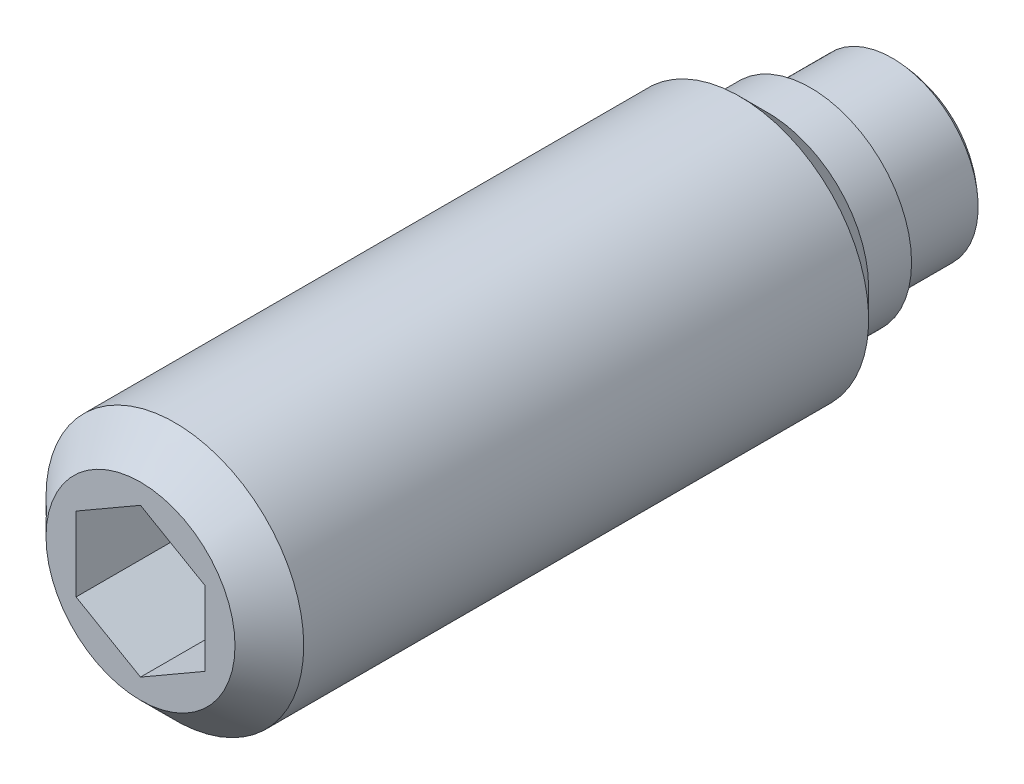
ISO-10303-21;
HEADER;
FILE_DESCRIPTION(('STEP AP214'),'2;1');
FILE_NAME('part.step','',(''),(''),'','','');
FILE_SCHEMA(('AUTOMOTIVE_DESIGN { 1 0 10303 214 1 1 1 1 }'));
ENDSEC;
DATA;
#1=APPLICATION_CONTEXT('core data for automotive mechanical design processes');
#2=APPLICATION_PROTOCOL_DEFINITION('international standard','automotive_design',2000,#1);
#3=PRODUCT_CONTEXT('',#1,'mechanical');
#4=PRODUCT('Part','Part','',(#3));
#5=PRODUCT_RELATED_PRODUCT_CATEGORY('part','',(#4));
#6=PRODUCT_DEFINITION_FORMATION('','',#4);
#7=PRODUCT_DEFINITION_CONTEXT('part definition',#1,'design');
#8=PRODUCT_DEFINITION('design','',#6,#7);
#9=PRODUCT_DEFINITION_SHAPE('','',#8);
#10=(LENGTH_UNIT() NAMED_UNIT(*) SI_UNIT(.MILLI.,.METRE.));
#11=(NAMED_UNIT(*) PLANE_ANGLE_UNIT() SI_UNIT($,.RADIAN.));
#12=(NAMED_UNIT(*) SI_UNIT($,.STERADIAN.) SOLID_ANGLE_UNIT());
#13=UNCERTAINTY_MEASURE_WITH_UNIT(LENGTH_MEASURE(1.E-05),#10,'distance_accuracy_value','');
#14=(GEOMETRIC_REPRESENTATION_CONTEXT(3) GLOBAL_UNCERTAINTY_ASSIGNED_CONTEXT((#13)) GLOBAL_UNIT_ASSIGNED_CONTEXT((#10,
#11,#12)) REPRESENTATION_CONTEXT('',''));
#15=CARTESIAN_POINT('',(0.,0.,0.));
#16=DIRECTION('',(0.,0.,1.));
#17=DIRECTION('',(1.,0.,0.));
#18=AXIS2_PLACEMENT_3D('',#15,#16,#17);
#19=CARTESIAN_POINT('',(0.,2.35,2.7));
#20=DIRECTION('',(0.,0.,1.));
#21=DIRECTION('',(1.,0.,0.));
#22=AXIS2_PLACEMENT_3D('',#19,#20,#21);
#23=PLANE('',#22);
#24=CARTESIAN_POINT('',(0.,0.,2.7));
#25=DIRECTION('',(0.,0.,-1.));
#26=DIRECTION('',(-1.,0.,0.));
#27=AXIS2_PLACEMENT_3D('',#24,#25,#26);
#28=CIRCLE('',#27,2.);
#29=CARTESIAN_POINT('',(-2.00000000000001,0.,2.7));
#30=VERTEX_POINT('',#29);
#31=EDGE_CURVE('E124',#30,#30,#28,.T.);
#32=ORIENTED_EDGE('',*,*,#31,.F.);
#33=EDGE_LOOP('',(#32));
#34=FACE_BOUND('',#33,.T.);
#35=CARTESIAN_POINT('',(0.,0.,2.7));
#36=DIRECTION('',(0.,0.,-1.));
#37=DIRECTION('',(-1.,0.,0.));
#38=AXIS2_PLACEMENT_3D('',#35,#36,#37);
#39=CIRCLE('',#38,2.35);
#40=CARTESIAN_POINT('',(-2.35000000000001,0.,2.7));
#41=VERTEX_POINT('',#40);
#42=EDGE_CURVE('E127',#41,#41,#39,.T.);
#43=ORIENTED_EDGE('',*,*,#42,.T.);
#44=EDGE_LOOP('',(#43));
#45=FACE_BOUND('',#44,.T.);
#46=ADVANCED_FACE('F14',(#34,#45),#23,.F.);
#47=CARTESIAN_POINT('',(0.,0.,2.7));
#48=DIRECTION('',(0.,0.,-1.));
#49=DIRECTION('',(-1.,0.,0.));
#50=AXIS2_PLACEMENT_3D('',#47,#48,#49);
#51=CYLINDRICAL_SURFACE('',#50,3.);
#52=CARTESIAN_POINT('',(0.,0.,17.5));
#53=DIRECTION('',(0.,0.,1.));
#54=DIRECTION('',(1.,0.,0.));
#55=AXIS2_PLACEMENT_3D('',#52,#53,#54);
#56=CIRCLE('',#55,3.);
#57=CARTESIAN_POINT('',(2.99999999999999,0.,17.5));
#58=VERTEX_POINT('',#57);
#59=EDGE_CURVE('E9',#58,#58,#56,.F.);
#60=ORIENTED_EDGE('',*,*,#59,.T.);
#61=EDGE_LOOP('',(#60));
#62=FACE_BOUND('',#61,.T.);
#63=CARTESIAN_POINT('',(0.,0.,4.35));
#64=DIRECTION('',(0.,0.,-1.));
#65=DIRECTION('',(-1.,0.,0.));
#66=AXIS2_PLACEMENT_3D('',#63,#64,#65);
#67=CIRCLE('',#66,3.);
#68=CARTESIAN_POINT('',(-3.00000000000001,0.,4.35));
#69=VERTEX_POINT('',#68);
#70=EDGE_CURVE('E133',#69,#69,#67,.T.);
#71=ORIENTED_EDGE('',*,*,#70,.F.);
#72=EDGE_LOOP('',(#71));
#73=FACE_BOUND('',#72,.T.);
#74=ADVANCED_FACE('F151',(#62,#73),#51,.T.);
#75=CARTESIAN_POINT('',(0.,0.,4.35));
#76=DIRECTION('',(0.,0.,1.));
#77=DIRECTION('',(1.,0.,0.));
#78=AXIS2_PLACEMENT_3D('',#75,#76,#77);
#79=CONICAL_SURFACE('',#78,3.,0.785398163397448);
#80=CARTESIAN_POINT('',(0.,0.,3.7));
#81=DIRECTION('',(0.,0.,-1.));
#82=DIRECTION('',(-1.,0.,0.));
#83=AXIS2_PLACEMENT_3D('',#80,#81,#82);
#84=CIRCLE('',#83,2.35);
#85=CARTESIAN_POINT('',(-2.35000000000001,0.,3.7));
#86=VERTEX_POINT('',#85);
#87=EDGE_CURVE('E130',#86,#86,#84,.T.);
#88=ORIENTED_EDGE('',*,*,#87,.F.);
#89=EDGE_LOOP('',(#88));
#90=FACE_BOUND('',#89,.T.);
#91=ORIENTED_EDGE('',*,*,#70,.T.);
#92=EDGE_LOOP('',(#91));
#93=FACE_BOUND('',#92,.T.);
#94=ADVANCED_FACE('F158',(#90,#93),#79,.T.);
#95=CARTESIAN_POINT('',(0.,0.,2.7));
#96=DIRECTION('',(0.,0.,-1.));
#97=DIRECTION('',(-1.,0.,0.));
#98=AXIS2_PLACEMENT_3D('',#95,#96,#97);
#99=CYLINDRICAL_SURFACE('',#98,2.35);
#100=ORIENTED_EDGE('',*,*,#42,.F.);
#101=EDGE_LOOP('',(#100));
#102=FACE_BOUND('',#101,.T.);
#103=ORIENTED_EDGE('',*,*,#87,.T.);
#104=EDGE_LOOP('',(#103));
#105=FACE_BOUND('',#104,.T.);
#106=ADVANCED_FACE('F166',(#102,#105),#99,.T.);
#107=CARTESIAN_POINT('',(0.,0.,0.));
#108=DIRECTION('',(0.,0.,-1.));
#109=DIRECTION('',(-1.,0.,0.));
#110=AXIS2_PLACEMENT_3D('',#107,#108,#109);
#111=CYLINDRICAL_SURFACE('',#110,2.);
#112=CARTESIAN_POINT('',(0.,0.,0.8));
#113=DIRECTION('',(0.,0.,-1.));
#114=DIRECTION('',(-1.,0.,0.));
#115=AXIS2_PLACEMENT_3D('',#112,#113,#114);
#116=CIRCLE('',#115,2.);
#117=CARTESIAN_POINT('',(-2.00000000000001,0.,0.8));
#118=VERTEX_POINT('',#117);
#119=EDGE_CURVE('E114',#118,#118,#116,.T.);
#120=ORIENTED_EDGE('',*,*,#119,.F.);
#121=EDGE_LOOP('',(#120));
#122=FACE_BOUND('',#121,.T.);
#123=ORIENTED_EDGE('',*,*,#31,.T.);
#124=EDGE_LOOP('',(#123));
#125=FACE_BOUND('',#124,.T.);
#126=ADVANCED_FACE('F164',(#122,#125),#111,.T.);
#127=CARTESIAN_POINT('',(0.0398938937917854,0.,2.9997347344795));
#128=DIRECTION('',(0.,-1.,0.));
#129=DIRECTION('',(-1.,0.,0.));
#130=AXIS2_PLACEMENT_3D('',#127,#128,#129);
#131=CIRCLE('',#130,3.00000000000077);
#132=TRIMMED_CURVE('',#131,(PARAMETER_VALUE(-1.55749797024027)),
(PARAMETER_VALUE(1.55749797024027)),.T.,.PARAMETER.);
#133=CARTESIAN_POINT('',(0.,0.,2.9997347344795));
#134=DIRECTION('',(0.,0.,-1.));
#135=AXIS1_PLACEMENT('',#133,#134);
#136=SURFACE_OF_REVOLUTION('',#132,#135);
#137=ORIENTED_EDGE('',*,*,#119,.T.);
#138=EDGE_LOOP('',(#137));
#139=FACE_BOUND('',#138,.T.);
#140=CARTESIAN_POINT('',(0.,0.,0.));
#141=VERTEX_POINT('',#140);
#142=VERTEX_LOOP('',#141);
#143=FACE_BOUND('',#142,.T.);
#144=ADVANCED_FACE('F198',(#139,#143),#136,.T.);
#145=CARTESIAN_POINT('',(0.,0.,18.3));
#146=DIRECTION('',(0.,0.,1.));
#147=DIRECTION('',(1.,0.,0.));
#148=AXIS2_PLACEMENT_3D('',#145,#146,#147);
#149=PLANE('',#148);
#150=CARTESIAN_POINT('',(0.,0.,18.3));
#151=DIRECTION('',(0.,0.,1.));
#152=DIRECTION('',(1.,0.,0.));
#153=AXIS2_PLACEMENT_3D('',#150,#151,#152);
#154=CIRCLE('',#153,2.2);
#155=CARTESIAN_POINT('',(2.19999999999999,0.,18.3));
#156=VERTEX_POINT('',#155);
#157=EDGE_CURVE('E22',#156,#156,#154,.T.);
#158=ORIENTED_EDGE('',*,*,#157,.T.);
#159=EDGE_LOOP('',(#158));
#160=FACE_BOUND('',#159,.T.);
#161=DIRECTION('',(-0.866025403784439,0.5,0.));
#162=VECTOR('',#161,1.);
#163=CARTESIAN_POINT('',(1.5,0.866025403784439,18.3));
#164=LINE('',#163,#162);
#165=CARTESIAN_POINT('',(1.5,0.866025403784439,18.3));
#166=VERTEX_POINT('',#165);
#167=CARTESIAN_POINT('',(0.,1.73205080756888,18.3));
#168=VERTEX_POINT('',#167);
#169=EDGE_CURVE('E29',#166,#168,#164,.T.);
#170=ORIENTED_EDGE('',*,*,#169,.F.);
#171=DIRECTION('',(0.,1.,0.));
#172=VECTOR('',#171,1.);
#173=CARTESIAN_POINT('',(1.5,-0.866025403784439,18.3));
#174=LINE('',#173,#172);
#175=CARTESIAN_POINT('',(1.5,-0.866025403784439,18.3));
#176=VERTEX_POINT('',#175);
#177=EDGE_CURVE('E88',#176,#166,#174,.T.);
#178=ORIENTED_EDGE('',*,*,#177,.F.);
#179=DIRECTION('',(0.866025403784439,0.5,0.));
#180=VECTOR('',#179,1.);
#181=CARTESIAN_POINT('',(0.,-1.73205080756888,18.3));
#182=LINE('',#181,#180);
#183=CARTESIAN_POINT('',(0.,-1.73205080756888,18.3));
#184=VERTEX_POINT('',#183);
#185=EDGE_CURVE('E91',#184,#176,#182,.T.);
#186=ORIENTED_EDGE('',*,*,#185,.F.);
#187=DIRECTION('',(0.866025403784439,-0.5,0.));
#188=VECTOR('',#187,1.);
#189=CARTESIAN_POINT('',(-1.5,-0.866025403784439,18.3));
#190=LINE('',#189,#188);
#191=CARTESIAN_POINT('',(-1.5,-0.866025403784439,18.3));
#192=VERTEX_POINT('',#191);
#193=EDGE_CURVE('E107',#192,#184,#190,.T.);
#194=ORIENTED_EDGE('',*,*,#193,.F.);
#195=DIRECTION('',(0.,-1.,0.));
#196=VECTOR('',#195,1.);
#197=CARTESIAN_POINT('',(-1.5,0.866025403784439,18.3));
#198=LINE('',#197,#196);
#199=CARTESIAN_POINT('',(-1.5,0.866025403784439,18.3));
#200=VERTEX_POINT('',#199);
#201=EDGE_CURVE('E104',#200,#192,#198,.T.);
#202=ORIENTED_EDGE('',*,*,#201,.F.);
#203=DIRECTION('',(-0.866025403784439,-0.5,0.));
#204=VECTOR('',#203,1.);
#205=CARTESIAN_POINT('',(0.,1.73205080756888,18.3));
#206=LINE('',#205,#204);
#207=EDGE_CURVE('E102',#168,#200,#206,.T.);
#208=ORIENTED_EDGE('',*,*,#207,.F.);
#209=EDGE_LOOP('',(#170,#178,#186,#194,#202,#208));
#210=FACE_BOUND('',#209,.T.);
#211=ADVANCED_FACE('F138',(#160,#210),#149,.T.);
#212=CARTESIAN_POINT('',(1.5,0.866025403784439,14.8));
#213=DIRECTION('',(0.5,0.866025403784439,0.));
#214=DIRECTION('',(-0.866025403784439,0.5,0.));
#215=AXIS2_PLACEMENT_3D('',#212,#213,#214);
#216=PLANE('',#215);
#217=ORIENTED_EDGE('',*,*,#169,.T.);
#218=DIRECTION('',(0.,0.,1.));
#219=VECTOR('',#218,1.);
#220=CARTESIAN_POINT('',(0.,1.73205080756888,14.8));
#221=LINE('',#220,#219);
#222=CARTESIAN_POINT('',(0.,1.73205080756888,14.8));
#223=VERTEX_POINT('',#222);
#224=EDGE_CURVE('E65',#223,#168,#221,.T.);
#225=ORIENTED_EDGE('',*,*,#224,.F.);
#226=DIRECTION('',(-0.866025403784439,0.5,0.));
#227=VECTOR('',#226,1.);
#228=CARTESIAN_POINT('',(1.5,0.866025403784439,14.8));
#229=LINE('',#228,#227);
#230=CARTESIAN_POINT('',(1.5,0.866025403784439,14.8));
#231=VERTEX_POINT('',#230);
#232=EDGE_CURVE('E69',#231,#223,#229,.T.);
#233=ORIENTED_EDGE('',*,*,#232,.F.);
#234=DIRECTION('',(0.,0.,1.));
#235=VECTOR('',#234,1.);
#236=CARTESIAN_POINT('',(1.5,0.866025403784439,14.8));
#237=LINE('',#236,#235);
#238=EDGE_CURVE('E112',#231,#166,#237,.T.);
#239=ORIENTED_EDGE('',*,*,#238,.T.);
#240=EDGE_LOOP('',(#217,#225,#233,#239));
#241=FACE_BOUND('',#240,.T.);
#242=ADVANCED_FACE('F67',(#241),#216,.F.);
#243=CARTESIAN_POINT('',(1.5,-0.866025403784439,14.8));
#244=DIRECTION('',(1.,0.,0.));
#245=DIRECTION('',(0.,0.,-1.));
#246=AXIS2_PLACEMENT_3D('',#243,#244,#245);
#247=PLANE('',#246);
#248=ORIENTED_EDGE('',*,*,#177,.T.);
#249=ORIENTED_EDGE('',*,*,#238,.F.);
#250=DIRECTION('',(0.,1.,0.));
#251=VECTOR('',#250,1.);
#252=CARTESIAN_POINT('',(1.5,-0.866025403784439,14.8));
#253=LINE('',#252,#251);
#254=CARTESIAN_POINT('',(1.5,-0.866025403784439,14.8));
#255=VERTEX_POINT('',#254);
#256=EDGE_CURVE('E75',#255,#231,#253,.T.);
#257=ORIENTED_EDGE('',*,*,#256,.F.);
#258=DIRECTION('',(0.,0.,1.));
#259=VECTOR('',#258,1.);
#260=CARTESIAN_POINT('',(1.5,-0.866025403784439,14.8));
#261=LINE('',#260,#259);
#262=EDGE_CURVE('E115',#255,#176,#261,.T.);
#263=ORIENTED_EDGE('',*,*,#262,.T.);
#264=EDGE_LOOP('',(#248,#249,#257,#263));
#265=FACE_BOUND('',#264,.T.);
#266=ADVANCED_FACE('F220',(#265),#247,.F.);
#267=CARTESIAN_POINT('',(0.,-1.73205080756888,14.8));
#268=DIRECTION('',(0.5,-0.866025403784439,0.));
#269=DIRECTION('',(0.866025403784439,0.5,0.));
#270=AXIS2_PLACEMENT_3D('',#267,#268,#269);
#271=PLANE('',#270);
#272=ORIENTED_EDGE('',*,*,#185,.T.);
#273=ORIENTED_EDGE('',*,*,#262,.F.);
#274=DIRECTION('',(0.866025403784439,0.5,0.));
#275=VECTOR('',#274,1.);
#276=CARTESIAN_POINT('',(0.,-1.73205080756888,14.8));
#277=LINE('',#276,#275);
#278=CARTESIAN_POINT('',(0.,-1.73205080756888,14.8));
#279=VERTEX_POINT('',#278);
#280=EDGE_CURVE('E98',#279,#255,#277,.T.);
#281=ORIENTED_EDGE('',*,*,#280,.F.);
#282=DIRECTION('',(0.,0.,1.));
#283=VECTOR('',#282,1.);
#284=CARTESIAN_POINT('',(0.,-1.73205080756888,14.8));
#285=LINE('',#284,#283);
#286=EDGE_CURVE('E117',#279,#184,#285,.T.);
#287=ORIENTED_EDGE('',*,*,#286,.T.);
#288=EDGE_LOOP('',(#272,#273,#281,#287));
#289=FACE_BOUND('',#288,.T.);
#290=ADVANCED_FACE('F228',(#289),#271,.F.);
#291=CARTESIAN_POINT('',(-1.5,-0.866025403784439,14.8));
#292=DIRECTION('',(-0.5,-0.866025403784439,0.));
#293=DIRECTION('',(0.866025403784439,-0.5,0.));
#294=AXIS2_PLACEMENT_3D('',#291,#292,#293);
#295=PLANE('',#294);
#296=ORIENTED_EDGE('',*,*,#193,.T.);
#297=ORIENTED_EDGE('',*,*,#286,.F.);
#298=DIRECTION('',(0.866025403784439,-0.5,0.));
#299=VECTOR('',#298,1.);
#300=CARTESIAN_POINT('',(-1.5,-0.866025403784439,14.8));
#301=LINE('',#300,#299);
#302=CARTESIAN_POINT('',(-1.5,-0.866025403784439,14.8));
#303=VERTEX_POINT('',#302);
#304=EDGE_CURVE('E95',#303,#279,#301,.T.);
#305=ORIENTED_EDGE('',*,*,#304,.F.);
#306=DIRECTION('',(0.,0.,1.));
#307=VECTOR('',#306,1.);
#308=CARTESIAN_POINT('',(-1.5,-0.866025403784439,14.8));
#309=LINE('',#308,#307);
#310=EDGE_CURVE('E119',#303,#192,#309,.T.);
#311=ORIENTED_EDGE('',*,*,#310,.T.);
#312=EDGE_LOOP('',(#296,#297,#305,#311));
#313=FACE_BOUND('',#312,.T.);
#314=ADVANCED_FACE('F237',(#313),#295,.F.);
#315=CARTESIAN_POINT('',(-1.5,0.866025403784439,14.8));
#316=DIRECTION('',(-1.,0.,0.));
#317=DIRECTION('',(0.,-1.,0.));
#318=AXIS2_PLACEMENT_3D('',#315,#316,#317);
#319=PLANE('',#318);
#320=ORIENTED_EDGE('',*,*,#201,.T.);
#321=ORIENTED_EDGE('',*,*,#310,.F.);
#322=DIRECTION('',(0.,-1.,0.));
#323=VECTOR('',#322,1.);
#324=CARTESIAN_POINT('',(-1.5,0.866025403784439,14.8));
#325=LINE('',#324,#323);
#326=CARTESIAN_POINT('',(-1.5,0.866025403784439,14.8));
#327=VERTEX_POINT('',#326);
#328=EDGE_CURVE('E83',#327,#303,#325,.T.);
#329=ORIENTED_EDGE('',*,*,#328,.F.);
#330=DIRECTION('',(0.,0.,1.));
#331=VECTOR('',#330,1.);
#332=CARTESIAN_POINT('',(-1.5,0.866025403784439,14.8));
#333=LINE('',#332,#331);
#334=EDGE_CURVE('E74',#327,#200,#333,.T.);
#335=ORIENTED_EDGE('',*,*,#334,.T.);
#336=EDGE_LOOP('',(#320,#321,#329,#335));
#337=FACE_BOUND('',#336,.T.);
#338=ADVANCED_FACE('F246',(#337),#319,.F.);
#339=CARTESIAN_POINT('',(0.,1.73205080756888,14.8));
#340=DIRECTION('',(-0.5,0.866025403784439,0.));
#341=DIRECTION('',(-0.866025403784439,-0.5,0.));
#342=AXIS2_PLACEMENT_3D('',#339,#340,#341);
#343=PLANE('',#342);
#344=ORIENTED_EDGE('',*,*,#207,.T.);
#345=ORIENTED_EDGE('',*,*,#334,.F.);
#346=DIRECTION('',(-0.866025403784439,-0.5,0.));
#347=VECTOR('',#346,1.);
#348=CARTESIAN_POINT('',(0.,1.73205080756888,14.8));
#349=LINE('',#348,#347);
#350=EDGE_CURVE('E78',#223,#327,#349,.T.);
#351=ORIENTED_EDGE('',*,*,#350,.F.);
#352=ORIENTED_EDGE('',*,*,#224,.T.);
#353=EDGE_LOOP('',(#344,#345,#351,#352));
#354=FACE_BOUND('',#353,.T.);
#355=ADVANCED_FACE('F79',(#354),#343,.F.);
#356=CARTESIAN_POINT('',(0.,0.,14.8));
#357=DIRECTION('',(0.,0.,1.));
#358=DIRECTION('',(1.,0.,0.));
#359=AXIS2_PLACEMENT_3D('',#356,#357,#358);
#360=PLANE('',#359);
#361=ORIENTED_EDGE('',*,*,#232,.T.);
#362=ORIENTED_EDGE('',*,*,#350,.T.);
#363=ORIENTED_EDGE('',*,*,#328,.T.);
#364=ORIENTED_EDGE('',*,*,#304,.T.);
#365=ORIENTED_EDGE('',*,*,#280,.T.);
#366=ORIENTED_EDGE('',*,*,#256,.T.);
#367=EDGE_LOOP('',(#361,#362,#363,#364,#365,#366));
#368=FACE_BOUND('',#367,.T.);
#369=ADVANCED_FACE('F85',(#368),#360,.T.);
#370=CARTESIAN_POINT('',(0.,0.,18.3));
#371=DIRECTION('',(0.,0.,-1.));
#372=DIRECTION('',(-1.,0.,0.));
#373=AXIS2_PLACEMENT_3D('',#370,#371,#372);
#374=CONICAL_SURFACE('',#373,2.2,0.785398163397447);
#375=ORIENTED_EDGE('',*,*,#59,.F.);
#376=EDGE_LOOP('',(#375));
#377=FACE_BOUND('',#376,.T.);
#378=ORIENTED_EDGE('',*,*,#157,.F.);
#379=EDGE_LOOP('',(#378));
#380=FACE_BOUND('',#379,.T.);
#381=ADVANCED_FACE('F16',(#377,#380),#374,.T.);
#382=CLOSED_SHELL('',(#46,#74,#94,#106,#126,#144,#211,#242,#266,#290,#314,#338,#355,#369,#381));
#383=MANIFOLD_SOLID_BREP('B1',#382);
#384=ADVANCED_BREP_SHAPE_REPRESENTATION('',(#18,#383),#14);
#385=SHAPE_DEFINITION_REPRESENTATION(#9,#384);
ENDSEC;
END-ISO-10303-21;
